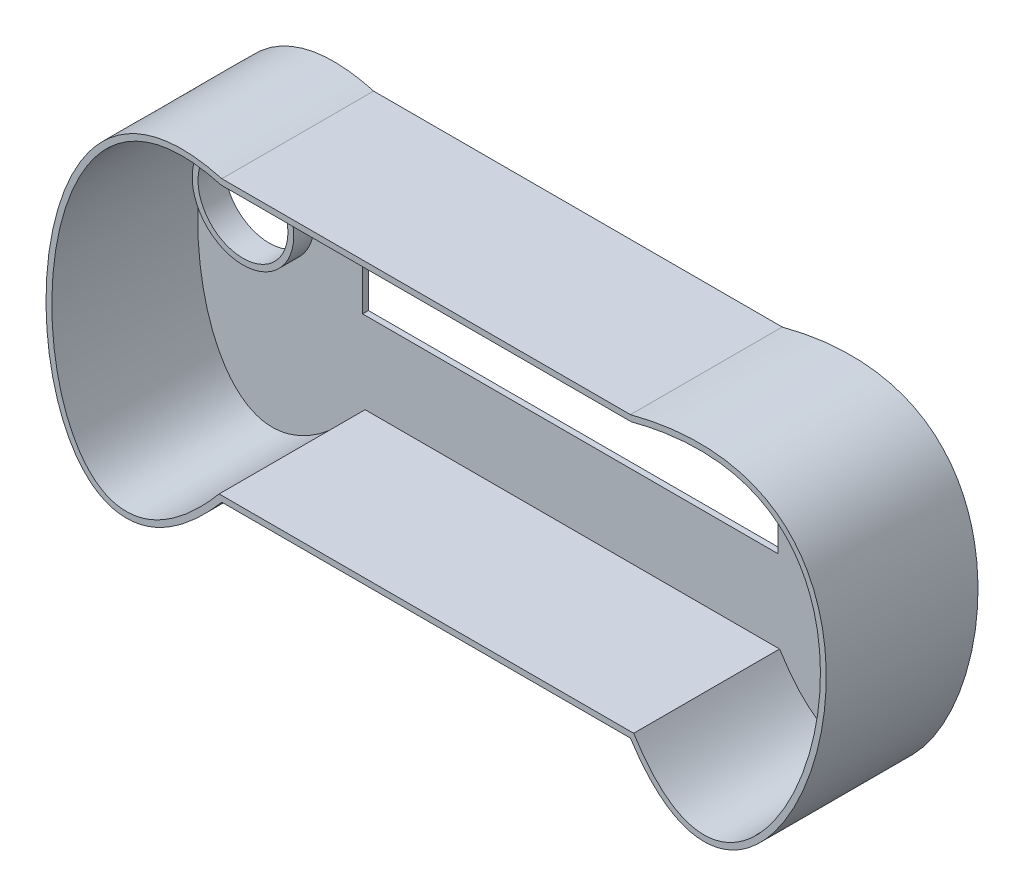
from build123d import *

# Parameters (mm, degrees)
BOSS_EXTRU_1_DEPTH      = 25
BOSS_EXTRU_2_DEPTH      = 1
ESQUISSE3_R             = 7.7
ESQUISSE3_W             = 71.2
ESQUISSE3_H             = 24.2
ENL_V_MAT_EXTRU_1_DEPTH = 1
ESQUISSE4_R             = 8.7
ESQUISSE4_R_2           = 7.7
BOSS_EXTRU_3_DEPTH      = 3.5


with BuildPart() as part:
    # Esquisse1 → Boss.-Extru.1 (new body)
    with BuildSketch(Plane.XY):
        with BuildLine():
            Line((105, 58.597115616), (35, 58.597115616))
            add(Edge.make_bspline(
                [(35, 58.597115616), (-8.527591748, 70.652829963), (-1.677744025, -32.397382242), (35, 10.597115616)],
                knots=[0, 0, 0, 0, 1, 1, 1, 1], degree=3))
            Line((35, 10.597115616), (105, 10.597115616))
            add(Edge.make_bspline(
                [(105, 58.597115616), (165.91639116, 74.58586119), (130.080420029, -28.901381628), (105, 10.597115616)],
                knots=[0, 0, 0, 0, 1, 1, 1, 1], degree=3))
        make_face()
        with BuildLine():
            Line((105.549591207, 11.597115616), (34.538642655, 11.597115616))
            add(Edge.make_bspline(
                [(34.864074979, 57.597115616), (34.535912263, 57.688005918), (33.869594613, 57.865370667), (32.589473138, 58.153875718), (31.030161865, 58.418469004), (29.241339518, 58.581367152), (26.957768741, 58.604750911), (24.292146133, 58.286808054), (20.405418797, 57.106191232), (16.206198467, 54.479470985), (12.148141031, 49.785507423), (9.078367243, 43.888503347), (7.001720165, 37.173689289), (5.9070076, 30.038163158), (5.771628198, 22.881617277), (6.564811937, 16.105015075), (8.245166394, 10.113845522), (10.750848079, 5.316104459), (13.965640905, 2.115066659), (17.123798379, 0.968872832), (20.050306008, 1.061048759), (22.483651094, 1.708715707), (25.158490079, 3.009370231), (27.578963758, 4.692895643), (29.622955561, 6.428154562), (31.207077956, 7.928700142), (32.571783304, 9.35542884), (33.682152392, 10.59403589), (34.256117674, 11.265933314), (34.538642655, 11.597115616)],
                knots=[-0.001003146, -0.001003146, -0.001003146, -0.001003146, 0.006838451, 0.014680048, 0.030363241, 0.046046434, 0.061729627, 0.093096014, 0.1244624, 0.187195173, 0.249927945, 0.312660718, 0.375393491, 0.438126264, 0.500859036, 0.563591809, 0.626324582, 0.689057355, 0.751790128, 0.8145229, 0.845889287, 0.877255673, 0.908622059, 0.939988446, 0.955671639, 0.971354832, 0.987038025, 0.994879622, 1.002721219, 1.002721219, 1.002721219, 1.002721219], degree=3))
            Line((34.864074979, 57.597115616), (105.129049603, 57.597115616))
            add(Edge.make_bspline(
                [(105.549591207, 11.597115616), (105.742871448, 11.292723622), (106.135036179, 10.671738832), (106.900552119, 9.543963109), (107.869141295, 8.25095539), (109.031038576, 6.909502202), (110.579617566, 5.381026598), (112.501335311, 3.944336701), (114.759186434, 2.906058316), (116.964436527, 2.475186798), (119.859318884, 2.625682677), (123.445511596, 4.092215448), (127.553943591, 7.688096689), (131.212939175, 12.769589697), (134.220877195, 18.93664269), (136.398638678, 25.785139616), (137.581039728, 32.910180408), (137.612889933, 39.905226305), (136.353566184, 46.362923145), (133.686555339, 51.886859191), (130.201078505, 55.434685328), (126.550601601, 57.500097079), (123.343547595, 58.61926883), (119.63337598, 59.257000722), (116.098863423, 59.340059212), (112.994018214, 59.108741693), (110.525791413, 58.779919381), (108.345988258, 58.369025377), (106.537919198, 57.958710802), (105.594228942, 57.719211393), (105.129049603, 57.597115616)],
                knots=[-0.000683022, -0.000683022, -0.000683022, -0.000683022, 0.007165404, 0.015013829, 0.03071068, 0.046407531, 0.062104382, 0.093498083, 0.124891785, 0.156285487, 0.187679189, 0.250466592, 0.313253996, 0.376041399, 0.438828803, 0.501616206, 0.564403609, 0.627191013, 0.689978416, 0.75276582, 0.815553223, 0.846946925, 0.878340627, 0.909734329, 0.94112803, 0.956824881, 0.972521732, 0.988218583, 0.996067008, 1.003915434, 1.003915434, 1.003915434, 1.003915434], degree=3))
        make_face(mode=Mode.SUBTRACT)
    extrude(amount=BOSS_EXTRU_1_DEPTH)

    # Esquisse2 → Boss.-Extru.2 (add)
    with BuildSketch(Plane(origin=(0, 0, 0), x_dir=(-1, 0, 0), z_dir=(0, 0, -1))):
        with BuildLine():
            Line((-35, 58.597115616), (-105, 58.597115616))
            add(Edge.make_bspline(
                [(-105, 58.597115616), (-165.91639116, 74.58586119), (-130.080420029, -28.901381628), (-105, 10.597115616)],
                knots=[0, 0, 0, 0, 1, 1, 1, 1], degree=3))
            Line((-105, 10.597115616), (-35, 10.597115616))
            add(Edge.make_bspline(
                [(-35, 10.597115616), (1.677744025, -32.397382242), (8.527591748, 70.652829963), (-35, 58.597115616)],
                knots=[0, 0, 0, 0, 1, 1, 1, 1], degree=3))
        make_face()
    extrude(amount=BOSS_EXTRU_2_DEPTH)

    # Esquisse3 → Enl_v. mat.-Extru.1 (cut)
    with BuildSketch(Plane(origin=(0, 0, -1), x_dir=(-1, 0, 0), z_dir=(0, 0, -1))):
        with Locations((-122.314735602, 34.797115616)):
            Circle(ESQUISSE3_R)
        with Locations((-17.114735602, 34.797115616)):
            Circle(ESQUISSE3_R)
        with Locations((-69.714735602, 37.697115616)):
            Rectangle(ESQUISSE3_W, ESQUISSE3_H)
    extrude(amount=-ENL_V_MAT_EXTRU_1_DEPTH, mode=Mode.SUBTRACT)

    # Esquisse4 → Boss.-Extru.3 (add)
    # profile 1 of 2: a face of its own
    with BuildSketch(Plane.XY):
        with Locations((17.114735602, 34.797115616)):
            Circle(ESQUISSE4_R)
        with Locations(Location((17.114735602, 34.797115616, 0), (0, 0, 180))):
            Circle(ESQUISSE4_R_2, mode=Mode.SUBTRACT)
    # profile 2 of 2: a face of its own
    with BuildSketch(Plane.XY):
        with Locations((122.314735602, 34.797115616)):
            Circle(ESQUISSE4_R)
        with Locations(Location((122.314735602, 34.797115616, 0), (0, 0, 180))):
            Circle(ESQUISSE4_R_2, mode=Mode.SUBTRACT)
    extrude(amount=BOSS_EXTRU_3_DEPTH)


solid = part.part
